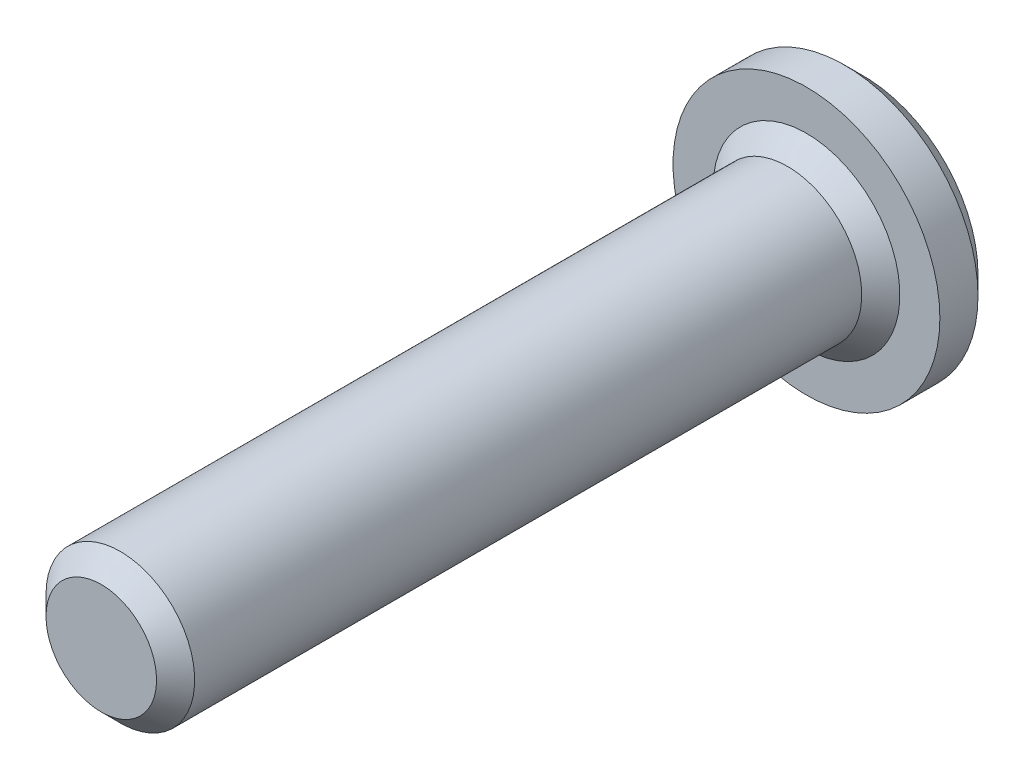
from build123d import *

# Parameters (mm, degrees)
SFAZOWANIE1_SIZE = 1


with BuildPart() as part:
    # Szkic2 → Obr_t1 (revolve)
    with BuildSketch(Plane(origin=(0, 0, 0), x_dir=(1, 0, 0), z_dir=(0, 1, 0)), mode=Mode.PRIVATE) as obr_t1_sk:
        Polygon((-7, 0), (-3.9, 0), (-3.9, -37), (0, -37), (0, 3), (-7, 3), align=None)
    revolve(obr_t1_sk.sketch.rotate(Axis((0, 0, 37), (0, 0, -1)), 180), axis=Axis((0, 0, 37), (0, 0, -1)))

    # Sfazowanie1
    sfazowanie1_edges = [part.edges().sort_by_distance(p)[0] for p in [
        (-3.9, 0, 0),
        (-3.9, 0, 37),
        (-7, 0, -3),
    ]]
    chamfer(sfazowanie1_edges, length=SFAZOWANIE1_SIZE)


solid = part.part
